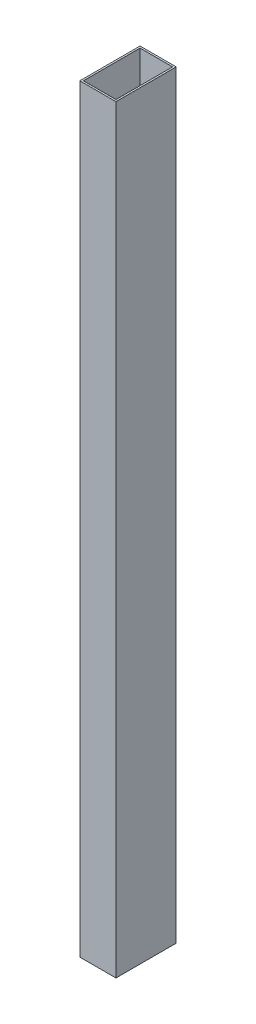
ISO-10303-21;
HEADER;
FILE_DESCRIPTION(('STEP AP214'),'2;1');
FILE_NAME('part.step','',(''),(''),'','','');
FILE_SCHEMA(('AUTOMOTIVE_DESIGN { 1 0 10303 214 1 1 1 1 }'));
ENDSEC;
DATA;
#1=APPLICATION_CONTEXT('core data for automotive mechanical design processes');
#2=APPLICATION_PROTOCOL_DEFINITION('international standard','automotive_design',2000,#1);
#3=PRODUCT_CONTEXT('',#1,'mechanical');
#4=PRODUCT('Part','Part','',(#3));
#5=PRODUCT_RELATED_PRODUCT_CATEGORY('part','',(#4));
#6=PRODUCT_DEFINITION_FORMATION('','',#4);
#7=PRODUCT_DEFINITION_CONTEXT('part definition',#1,'design');
#8=PRODUCT_DEFINITION('design','',#6,#7);
#9=PRODUCT_DEFINITION_SHAPE('','',#8);
#10=(LENGTH_UNIT() NAMED_UNIT(*) SI_UNIT(.MILLI.,.METRE.));
#11=(NAMED_UNIT(*) PLANE_ANGLE_UNIT() SI_UNIT($,.RADIAN.));
#12=(NAMED_UNIT(*) SI_UNIT($,.STERADIAN.) SOLID_ANGLE_UNIT());
#13=UNCERTAINTY_MEASURE_WITH_UNIT(LENGTH_MEASURE(1.E-05),#10,'distance_accuracy_value','');
#14=(GEOMETRIC_REPRESENTATION_CONTEXT(3) GLOBAL_UNCERTAINTY_ASSIGNED_CONTEXT((#13)) GLOBAL_UNIT_ASSIGNED_CONTEXT((#10,
#11,#12)) REPRESENTATION_CONTEXT('',''));
#15=CARTESIAN_POINT('',(0.,0.,0.));
#16=DIRECTION('',(0.,0.,1.));
#17=DIRECTION('',(1.,0.,0.));
#18=AXIS2_PLACEMENT_3D('',#15,#16,#17);
#19=CARTESIAN_POINT('',(15.,630.,-25.));
#20=DIRECTION('',(-1.,0.,0.));
#21=DIRECTION('',(0.,0.,1.));
#22=AXIS2_PLACEMENT_3D('',#19,#20,#21);
#23=PLANE('',#22);
#24=DIRECTION('',(0.,0.,-1.));
#25=VECTOR('',#24,1.);
#26=CARTESIAN_POINT('',(15.,0.,-25.));
#27=LINE('',#26,#25);
#28=CARTESIAN_POINT('',(15.,0.,25.));
#29=VERTEX_POINT('',#28);
#30=CARTESIAN_POINT('',(15.,0.,-25.));
#31=VERTEX_POINT('',#30);
#32=EDGE_CURVE('E142',#29,#31,#27,.T.);
#33=ORIENTED_EDGE('',*,*,#32,.T.);
#34=DIRECTION('',(0.,-1.,0.));
#35=VECTOR('',#34,1.);
#36=CARTESIAN_POINT('',(15.,630.,-25.));
#37=LINE('',#36,#35);
#38=CARTESIAN_POINT('',(15.,630.,-25.));
#39=VERTEX_POINT('',#38);
#40=EDGE_CURVE('E11',#39,#31,#37,.T.);
#41=ORIENTED_EDGE('',*,*,#40,.F.);
#42=DIRECTION('',(0.,0.,-1.));
#43=VECTOR('',#42,1.);
#44=CARTESIAN_POINT('',(15.,630.,-25.));
#45=LINE('',#44,#43);
#46=CARTESIAN_POINT('',(15.,630.,25.));
#47=VERTEX_POINT('',#46);
#48=EDGE_CURVE('E131',#47,#39,#45,.T.);
#49=ORIENTED_EDGE('',*,*,#48,.F.);
#50=DIRECTION('',(0.,-1.,0.));
#51=VECTOR('',#50,1.);
#52=CARTESIAN_POINT('',(15.,630.,25.));
#53=LINE('',#52,#51);
#54=EDGE_CURVE('E141',#47,#29,#53,.T.);
#55=ORIENTED_EDGE('',*,*,#54,.T.);
#56=EDGE_LOOP('',(#33,#41,#49,#55));
#57=FACE_BOUND('',#56,.T.);
#58=ADVANCED_FACE('F34',(#57),#23,.F.);
#59=CARTESIAN_POINT('',(-15.,630.,-25.));
#60=DIRECTION('',(0.,0.,1.));
#61=DIRECTION('',(1.,0.,0.));
#62=AXIS2_PLACEMENT_3D('',#59,#60,#61);
#63=PLANE('',#62);
#64=DIRECTION('',(-1.,0.,0.));
#65=VECTOR('',#64,1.);
#66=CARTESIAN_POINT('',(-15.,0.,-25.));
#67=LINE('',#66,#65);
#68=CARTESIAN_POINT('',(-15.,0.,-25.));
#69=VERTEX_POINT('',#68);
#70=EDGE_CURVE('E145',#31,#69,#67,.T.);
#71=ORIENTED_EDGE('',*,*,#70,.T.);
#72=DIRECTION('',(0.,-1.,0.));
#73=VECTOR('',#72,1.);
#74=CARTESIAN_POINT('',(-15.,630.,-25.));
#75=LINE('',#74,#73);
#76=CARTESIAN_POINT('',(-15.,630.,-25.));
#77=VERTEX_POINT('',#76);
#78=EDGE_CURVE('E41',#77,#69,#75,.T.);
#79=ORIENTED_EDGE('',*,*,#78,.F.);
#80=DIRECTION('',(-1.,0.,0.));
#81=VECTOR('',#80,1.);
#82=CARTESIAN_POINT('',(-15.,630.,-25.));
#83=LINE('',#82,#81);
#84=EDGE_CURVE('E134',#39,#77,#83,.T.);
#85=ORIENTED_EDGE('',*,*,#84,.F.);
#86=ORIENTED_EDGE('',*,*,#40,.T.);
#87=EDGE_LOOP('',(#71,#79,#85,#86));
#88=FACE_BOUND('',#87,.T.);
#89=ADVANCED_FACE('F173',(#88),#63,.F.);
#90=CARTESIAN_POINT('',(-15.,630.,-25.));
#91=DIRECTION('',(1.,0.,0.));
#92=DIRECTION('',(0.,0.,-1.));
#93=AXIS2_PLACEMENT_3D('',#90,#91,#92);
#94=PLANE('',#93);
#95=DIRECTION('',(0.,0.,1.));
#96=VECTOR('',#95,1.);
#97=CARTESIAN_POINT('',(-15.,0.,-25.));
#98=LINE('',#97,#96);
#99=CARTESIAN_POINT('',(-15.,0.,25.));
#100=VERTEX_POINT('',#99);
#101=EDGE_CURVE('E147',#69,#100,#98,.T.);
#102=ORIENTED_EDGE('',*,*,#101,.T.);
#103=DIRECTION('',(0.,-1.,0.));
#104=VECTOR('',#103,1.);
#105=CARTESIAN_POINT('',(-15.,630.,25.));
#106=LINE('',#105,#104);
#107=CARTESIAN_POINT('',(-15.,630.,25.));
#108=VERTEX_POINT('',#107);
#109=EDGE_CURVE('E152',#108,#100,#106,.T.);
#110=ORIENTED_EDGE('',*,*,#109,.F.);
#111=DIRECTION('',(0.,0.,1.));
#112=VECTOR('',#111,1.);
#113=CARTESIAN_POINT('',(-15.,630.,-25.));
#114=LINE('',#113,#112);
#115=EDGE_CURVE('E137',#77,#108,#114,.T.);
#116=ORIENTED_EDGE('',*,*,#115,.F.);
#117=ORIENTED_EDGE('',*,*,#78,.T.);
#118=EDGE_LOOP('',(#102,#110,#116,#117));
#119=FACE_BOUND('',#118,.T.);
#120=ADVANCED_FACE('F159',(#119),#94,.F.);
#121=CARTESIAN_POINT('',(-15.,630.,25.));
#122=DIRECTION('',(0.,0.,-1.));
#123=DIRECTION('',(-1.,0.,0.));
#124=AXIS2_PLACEMENT_3D('',#121,#122,#123);
#125=PLANE('',#124);
#126=DIRECTION('',(1.,0.,0.));
#127=VECTOR('',#126,1.);
#128=CARTESIAN_POINT('',(-15.,0.,25.));
#129=LINE('',#128,#127);
#130=EDGE_CURVE('E135',#100,#29,#129,.T.);
#131=ORIENTED_EDGE('',*,*,#130,.T.);
#132=ORIENTED_EDGE('',*,*,#54,.F.);
#133=DIRECTION('',(1.,0.,0.));
#134=VECTOR('',#133,1.);
#135=CARTESIAN_POINT('',(-15.,630.,25.));
#136=LINE('',#135,#134);
#137=EDGE_CURVE('E139',#108,#47,#136,.T.);
#138=ORIENTED_EDGE('',*,*,#137,.F.);
#139=ORIENTED_EDGE('',*,*,#109,.T.);
#140=EDGE_LOOP('',(#131,#132,#138,#139));
#141=FACE_BOUND('',#140,.T.);
#142=ADVANCED_FACE('F166',(#141),#125,.F.);
#143=CARTESIAN_POINT('',(0.,630.,0.));
#144=DIRECTION('',(0.,1.,0.));
#145=DIRECTION('',(0.,0.,1.));
#146=AXIS2_PLACEMENT_3D('',#143,#144,#145);
#147=PLANE('',#146);
#148=DIRECTION('',(0.,0.,-1.));
#149=VECTOR('',#148,1.);
#150=CARTESIAN_POINT('',(13.5,630.,-25.));
#151=LINE('',#150,#149);
#152=CARTESIAN_POINT('',(13.5,630.,23.5));
#153=VERTEX_POINT('',#152);
#154=CARTESIAN_POINT('',(13.5,630.,-23.5));
#155=VERTEX_POINT('',#154);
#156=EDGE_CURVE('E119',#153,#155,#151,.T.);
#157=ORIENTED_EDGE('',*,*,#156,.F.);
#158=DIRECTION('',(1.,0.,0.));
#159=VECTOR('',#158,1.);
#160=CARTESIAN_POINT('',(-15.,630.,23.5));
#161=LINE('',#160,#159);
#162=CARTESIAN_POINT('',(-13.5,630.,23.5));
#163=VERTEX_POINT('',#162);
#164=EDGE_CURVE('E103',#163,#153,#161,.T.);
#165=ORIENTED_EDGE('',*,*,#164,.F.);
#166=DIRECTION('',(0.,0.,1.));
#167=VECTOR('',#166,1.);
#168=CARTESIAN_POINT('',(-13.5,630.,-25.));
#169=LINE('',#168,#167);
#170=CARTESIAN_POINT('',(-13.5,630.,-23.5));
#171=VERTEX_POINT('',#170);
#172=EDGE_CURVE('E128',#171,#163,#169,.T.);
#173=ORIENTED_EDGE('',*,*,#172,.F.);
#174=DIRECTION('',(-1.,0.,0.));
#175=VECTOR('',#174,1.);
#176=CARTESIAN_POINT('',(-15.,630.,-23.5));
#177=LINE('',#176,#175);
#178=EDGE_CURVE('E121',#155,#171,#177,.T.);
#179=ORIENTED_EDGE('',*,*,#178,.F.);
#180=EDGE_LOOP('',(#157,#165,#173,#179));
#181=FACE_BOUND('',#180,.T.);
#182=ORIENTED_EDGE('',*,*,#48,.T.);
#183=ORIENTED_EDGE('',*,*,#84,.T.);
#184=ORIENTED_EDGE('',*,*,#115,.T.);
#185=ORIENTED_EDGE('',*,*,#137,.T.);
#186=EDGE_LOOP('',(#182,#183,#184,#185));
#187=FACE_BOUND('',#186,.T.);
#188=ADVANCED_FACE('F172',(#181,#187),#147,.T.);
#189=CARTESIAN_POINT('',(0.,0.,0.));
#190=DIRECTION('',(0.,1.,0.));
#191=DIRECTION('',(0.,0.,1.));
#192=AXIS2_PLACEMENT_3D('',#189,#190,#191);
#193=PLANE('',#192);
#194=DIRECTION('',(1.,0.,0.));
#195=VECTOR('',#194,1.);
#196=CARTESIAN_POINT('',(-15.,0.,23.5));
#197=LINE('',#196,#195);
#198=CARTESIAN_POINT('',(-13.5,0.,23.5));
#199=VERTEX_POINT('',#198);
#200=CARTESIAN_POINT('',(13.5,0.,23.5));
#201=VERTEX_POINT('',#200);
#202=EDGE_CURVE('E101',#199,#201,#197,.T.);
#203=ORIENTED_EDGE('',*,*,#202,.T.);
#204=DIRECTION('',(0.,0.,-1.));
#205=VECTOR('',#204,1.);
#206=CARTESIAN_POINT('',(13.5,0.,-25.));
#207=LINE('',#206,#205);
#208=CARTESIAN_POINT('',(13.5,0.,-23.5));
#209=VERTEX_POINT('',#208);
#210=EDGE_CURVE('E109',#201,#209,#207,.T.);
#211=ORIENTED_EDGE('',*,*,#210,.T.);
#212=DIRECTION('',(-1.,0.,0.));
#213=VECTOR('',#212,1.);
#214=CARTESIAN_POINT('',(-15.,0.,-23.5));
#215=LINE('',#214,#213);
#216=CARTESIAN_POINT('',(-13.5,0.,-23.5));
#217=VERTEX_POINT('',#216);
#218=EDGE_CURVE('E115',#209,#217,#215,.T.);
#219=ORIENTED_EDGE('',*,*,#218,.T.);
#220=DIRECTION('',(0.,0.,1.));
#221=VECTOR('',#220,1.);
#222=CARTESIAN_POINT('',(-13.5,0.,-25.));
#223=LINE('',#222,#221);
#224=EDGE_CURVE('E55',#217,#199,#223,.T.);
#225=ORIENTED_EDGE('',*,*,#224,.T.);
#226=EDGE_LOOP('',(#203,#211,#219,#225));
#227=FACE_BOUND('',#226,.T.);
#228=ORIENTED_EDGE('',*,*,#32,.F.);
#229=ORIENTED_EDGE('',*,*,#130,.F.);
#230=ORIENTED_EDGE('',*,*,#101,.F.);
#231=ORIENTED_EDGE('',*,*,#70,.F.);
#232=EDGE_LOOP('',(#228,#229,#230,#231));
#233=FACE_BOUND('',#232,.T.);
#234=ADVANCED_FACE('F117',(#227,#233),#193,.F.);
#235=CARTESIAN_POINT('',(13.5,630.,-25.));
#236=DIRECTION('',(-1.,0.,0.));
#237=DIRECTION('',(0.,0.,1.));
#238=AXIS2_PLACEMENT_3D('',#235,#236,#237);
#239=PLANE('',#238);
#240=ORIENTED_EDGE('',*,*,#210,.F.);
#241=DIRECTION('',(0.,-1.,0.));
#242=VECTOR('',#241,1.);
#243=CARTESIAN_POINT('',(13.5,630.,23.5));
#244=LINE('',#243,#242);
#245=EDGE_CURVE('E97',#153,#201,#244,.T.);
#246=ORIENTED_EDGE('',*,*,#245,.F.);
#247=ORIENTED_EDGE('',*,*,#156,.T.);
#248=DIRECTION('',(0.,-1.,0.));
#249=VECTOR('',#248,1.);
#250=CARTESIAN_POINT('',(13.5,630.,-23.5));
#251=LINE('',#250,#249);
#252=EDGE_CURVE('E112',#155,#209,#251,.T.);
#253=ORIENTED_EDGE('',*,*,#252,.T.);
#254=EDGE_LOOP('',(#240,#246,#247,#253));
#255=FACE_BOUND('',#254,.T.);
#256=ADVANCED_FACE('F110',(#255),#239,.T.);
#257=CARTESIAN_POINT('',(-15.,630.,-23.5));
#258=DIRECTION('',(0.,0.,1.));
#259=DIRECTION('',(1.,0.,0.));
#260=AXIS2_PLACEMENT_3D('',#257,#258,#259);
#261=PLANE('',#260);
#262=ORIENTED_EDGE('',*,*,#218,.F.);
#263=ORIENTED_EDGE('',*,*,#252,.F.);
#264=ORIENTED_EDGE('',*,*,#178,.T.);
#265=DIRECTION('',(0.,-1.,0.));
#266=VECTOR('',#265,1.);
#267=CARTESIAN_POINT('',(-13.5,630.,-23.5));
#268=LINE('',#267,#266);
#269=EDGE_CURVE('E257',#171,#217,#268,.T.);
#270=ORIENTED_EDGE('',*,*,#269,.T.);
#271=EDGE_LOOP('',(#262,#263,#264,#270));
#272=FACE_BOUND('',#271,.T.);
#273=ADVANCED_FACE('F193',(#272),#261,.T.);
#274=CARTESIAN_POINT('',(-13.5,630.,-25.));
#275=DIRECTION('',(1.,0.,0.));
#276=DIRECTION('',(0.,0.,-1.));
#277=AXIS2_PLACEMENT_3D('',#274,#275,#276);
#278=PLANE('',#277);
#279=ORIENTED_EDGE('',*,*,#224,.F.);
#280=ORIENTED_EDGE('',*,*,#269,.F.);
#281=ORIENTED_EDGE('',*,*,#172,.T.);
#282=DIRECTION('',(0.,-1.,0.));
#283=VECTOR('',#282,1.);
#284=CARTESIAN_POINT('',(-13.5,630.,23.5));
#285=LINE('',#284,#283);
#286=EDGE_CURVE('E48',#163,#199,#285,.T.);
#287=ORIENTED_EDGE('',*,*,#286,.T.);
#288=EDGE_LOOP('',(#279,#280,#281,#287));
#289=FACE_BOUND('',#288,.T.);
#290=ADVANCED_FACE('F190',(#289),#278,.T.);
#291=CARTESIAN_POINT('',(-15.,630.,23.5));
#292=DIRECTION('',(0.,0.,-1.));
#293=DIRECTION('',(-1.,0.,0.));
#294=AXIS2_PLACEMENT_3D('',#291,#292,#293);
#295=PLANE('',#294);
#296=ORIENTED_EDGE('',*,*,#202,.F.);
#297=ORIENTED_EDGE('',*,*,#286,.F.);
#298=ORIENTED_EDGE('',*,*,#164,.T.);
#299=ORIENTED_EDGE('',*,*,#245,.T.);
#300=EDGE_LOOP('',(#296,#297,#298,#299));
#301=FACE_BOUND('',#300,.T.);
#302=ADVANCED_FACE('F99',(#301),#295,.T.);
#303=CLOSED_SHELL('',(#58,#89,#120,#142,#188,#234,#256,#273,#290,#302));
#304=MANIFOLD_SOLID_BREP('B2',#303);
#305=ADVANCED_BREP_SHAPE_REPRESENTATION('',(#18,#304),#14);
#306=SHAPE_DEFINITION_REPRESENTATION(#9,#305);
ENDSEC;
END-ISO-10303-21;
